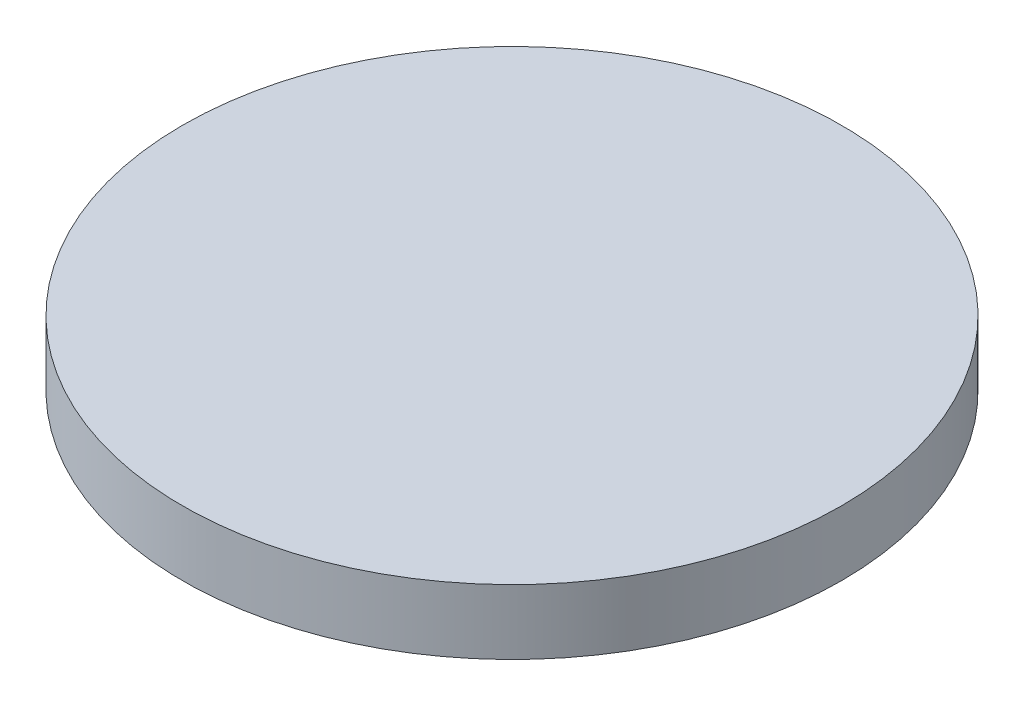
from build123d import *


with BuildPart() as part:
    # Sketch 1 → Revolve 1 (revolve)
    with BuildSketch(Plane.XY, mode=Mode.PRIVATE) as revolve_1_sk:
        with BuildLine():
            Line((25.4, 1.791753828), (25.4, 6.791753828))
            Line((25.4, 6.791753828), (0, 6.791753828))
            Line((0, 6.791753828), (0, 0))
            add(Edge.make_bspline(
                [(0, 0), (0.190853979, 0), (0.572752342, 0.001026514), (1.483834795, 0.005644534), (2.222531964, 0.017936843), (3.242971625, 0.036265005), (4.094561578, 0.060581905), (5.047667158, 0.090659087), (5.939434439, 0.126492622), (6.867159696, 0.167632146), (7.774209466, 0.214298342), (8.690819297, 0.265550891), (9.605399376, 0.322308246), (10.513912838, 0.38241421), (11.436315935, 0.448638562), (12.522040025, 0.530170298), (13.887067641, 0.641631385), (15.381022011, 0.769879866), (17.265856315, 0.946586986), (18.935688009, 1.108518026), (20.998321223, 1.32084602), (22.424613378, 1.469436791), (24.275748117, 1.669418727), (25.020548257, 1.750313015), (25.4, 1.791753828)],
                knots=[0.083156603, 0.083156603, 0.083156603, 0.083156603, 0.083156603, 0.113122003, 0.143087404, 0.173052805, 0.203018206, 0.232983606, 0.262949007, 0.292914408, 0.322879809, 0.35284521, 0.382810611, 0.412776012, 0.442741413, 0.472706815, 0.502672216, 0.557596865, 0.617527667, 0.677458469, 0.737389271, 0.797320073, 0.857250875, 0.917181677, 0.917181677, 0.917181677, 0.917181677, 0.917181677], degree=4))
        make_face()
    revolve(revolve_1_sk.sketch.rotate(Axis((0, 6.791753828, 0), (0, -1, 0)), 180), axis=Axis((0, 6.791753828, 0), (0, -1, 0)))


solid = part.part
